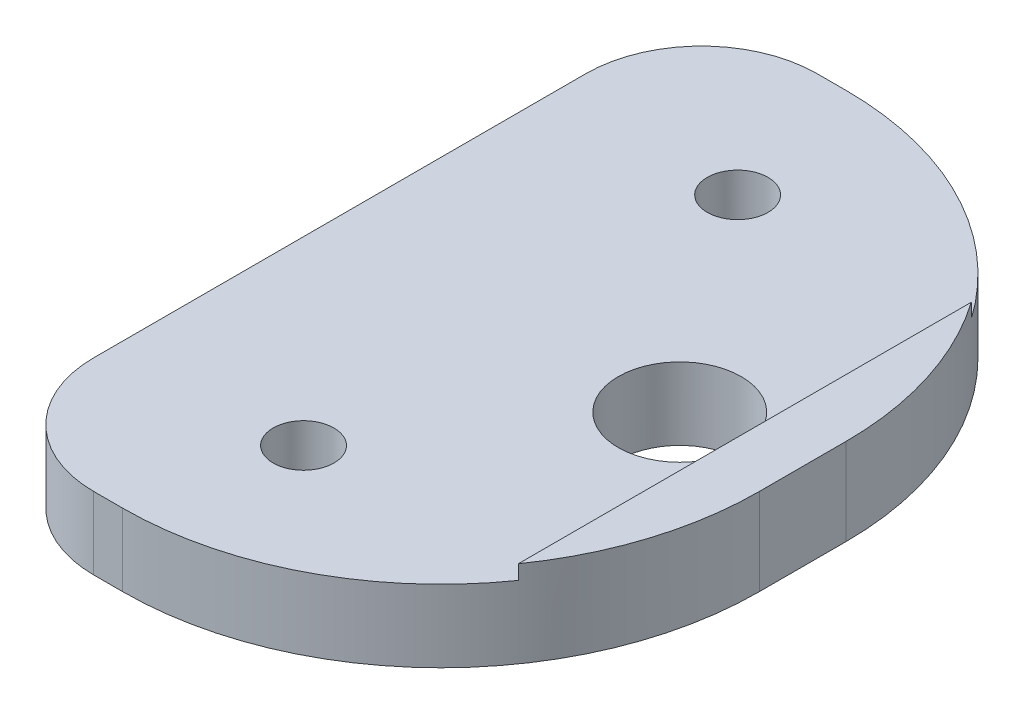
from build123d import *

# Parameters (mm, degrees)
BASE_EXTRUSION_DEPTH    = 25
CONG_1_R                = 22
CONG_2_R                = 22
CONG_3_R                = 8
ESQUISSE2_R             = 4.25
ESQUISSE2_R_2           = 2.1
ENL_V_MAT_EXTRU_1_DEPTH = 31.282007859


with BuildPart() as part:
    # Esquisse1 → Base-Extrusion (new, symmetric)
    with BuildSketch(Plane.XY):
        Polygon((-16, 0), (16, 0), (16, 6), (12, 6), (12, 5), (-16, 5), align=None)
    extrude(amount=BASE_EXTRUSION_DEPTH, both=True)

    # Cong_1
    cong_1_edges = [part.edges().sort_by_distance(p)[0] for p in [
        (16, 3, 25),
    ]]
    fillet(cong_1_edges, radius=CONG_1_R)

    # Cong_2
    cong_2_edges = [part.edges().sort_by_distance(p)[0] for p in [
        (16, 3, -25),
    ]]
    fillet(cong_2_edges, radius=CONG_2_R)

    # Cong_3
    cong_3_edges = [part.edges().sort_by_distance(p)[0] for p in [
        (-16, 2.5, -25),
        (-16, 2.5, 25),
    ]]
    fillet(cong_3_edges, radius=CONG_3_R)

    # Esquisse2 → Enl_v. mat.-Extru.1 (cut, through all)
    with BuildSketch(Plane.XZ):
        with Locations(Location((7.5, 0, 0), (0, 0, 270))):
            Circle(ESQUISSE2_R)
        with Locations(Location((-3.5, -15, 0), (0, 0, 270))):
            Circle(ESQUISSE2_R_2)
        with Locations(Location((-3.5, 15, 0), (0, 0, 270))):
            Circle(ESQUISSE2_R_2)
    extrude(amount=-ENL_V_MAT_EXTRU_1_DEPTH, mode=Mode.SUBTRACT)


solid = part.part
